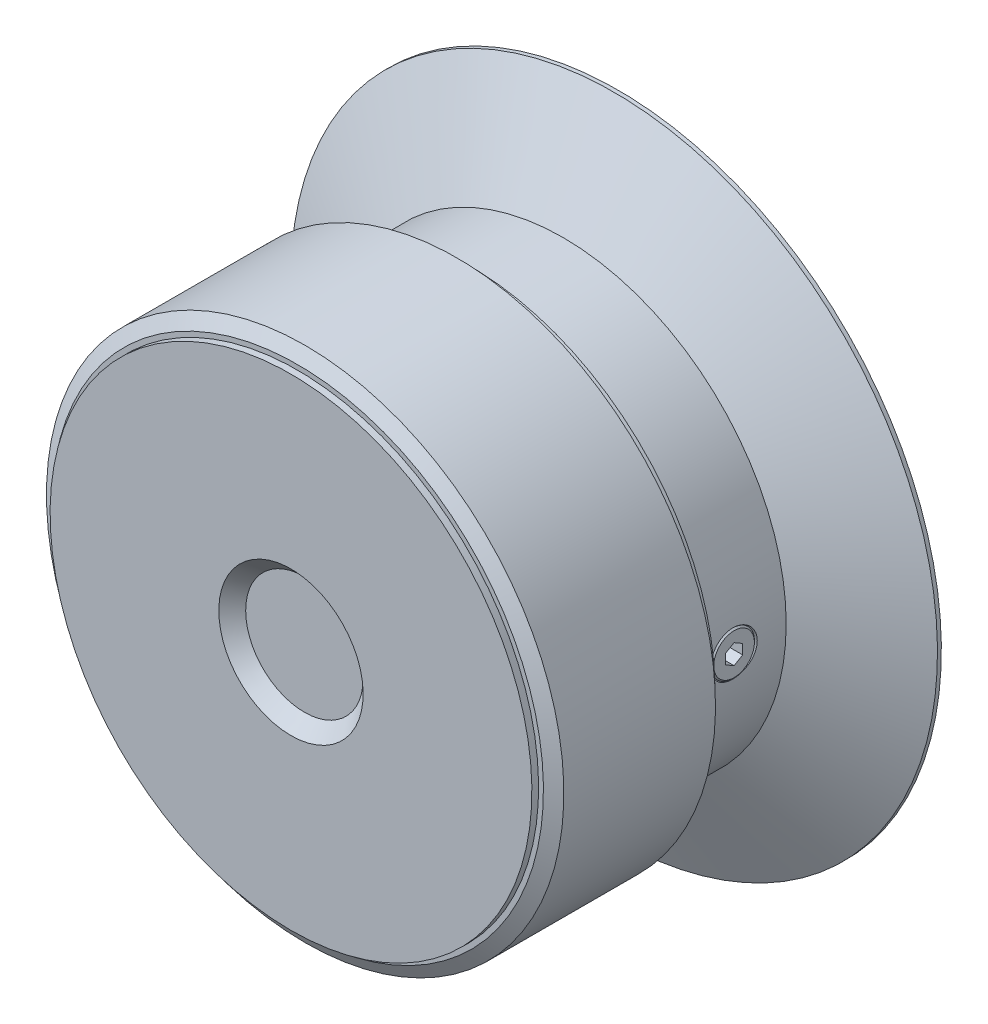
ISO-10303-21;
HEADER;
FILE_DESCRIPTION(('STEP AP214'),'2;1');
FILE_NAME('part.step','',(''),(''),'','','');
FILE_SCHEMA(('AUTOMOTIVE_DESIGN { 1 0 10303 214 1 1 1 1 }'));
ENDSEC;
DATA;
#1=APPLICATION_CONTEXT('core data for automotive mechanical design processes');
#2=APPLICATION_PROTOCOL_DEFINITION('international standard','automotive_design',2000,#1);
#3=PRODUCT_CONTEXT('',#1,'mechanical');
#4=PRODUCT('Part','Part','',(#3));
#5=PRODUCT_RELATED_PRODUCT_CATEGORY('part','',(#4));
#6=PRODUCT_DEFINITION_FORMATION('','',#4);
#7=PRODUCT_DEFINITION_CONTEXT('part definition',#1,'design');
#8=PRODUCT_DEFINITION('design','',#6,#7);
#9=PRODUCT_DEFINITION_SHAPE('','',#8);
#10=(LENGTH_UNIT() NAMED_UNIT(*) SI_UNIT(.MILLI.,.METRE.));
#11=(NAMED_UNIT(*) PLANE_ANGLE_UNIT() SI_UNIT($,.RADIAN.));
#12=(NAMED_UNIT(*) SI_UNIT($,.STERADIAN.) SOLID_ANGLE_UNIT());
#13=UNCERTAINTY_MEASURE_WITH_UNIT(LENGTH_MEASURE(1.E-05),#10,'distance_accuracy_value','');
#14=(GEOMETRIC_REPRESENTATION_CONTEXT(3) GLOBAL_UNCERTAINTY_ASSIGNED_CONTEXT((#13)) GLOBAL_UNIT_ASSIGNED_CONTEXT((#10,
#11,#12)) REPRESENTATION_CONTEXT('',''));
#15=CARTESIAN_POINT('',(0.,0.,0.));
#16=DIRECTION('',(0.,0.,1.));
#17=DIRECTION('',(1.,0.,0.));
#18=AXIS2_PLACEMENT_3D('',#15,#16,#17);
#19=CARTESIAN_POINT('',(17.45,0.,9.));
#20=DIRECTION('',(1.,0.,0.));
#21=DIRECTION('',(0.,0.,-1.));
#22=AXIS2_PLACEMENT_3D('',#19,#20,#21);
#23=CONICAL_SURFACE('',#22,2.,0.785398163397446);
#24=CARTESIAN_POINT('',(17.2061921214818,-1.22859785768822,7.7451063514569));
#25=CARTESIAN_POINT('',(17.2104098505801,-1.16952644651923,7.68137068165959));
#26=CARTESIAN_POINT('',(17.2146587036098,-1.10573725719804,7.62199444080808));
#27=CARTESIAN_POINT('',(17.2228450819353,-0.96991517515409,7.51346370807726));
#28=CARTESIAN_POINT('',(17.2267824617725,-0.897878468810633,7.46431397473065));
#29=CARTESIAN_POINT('',(17.2344139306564,-0.737976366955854,7.372427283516));
#30=CARTESIAN_POINT('',(17.2380219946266,-0.649249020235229,7.33116963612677));
#31=CARTESIAN_POINT('',(17.2439514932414,-0.465876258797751,7.26485773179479));
#32=CARTESIAN_POINT('',(17.24627290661,-0.371230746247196,7.2398037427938));
#33=CARTESIAN_POINT('',(17.249273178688,-0.183131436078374,7.20764057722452));
#34=CARTESIAN_POINT('',(17.2500187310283,-0.0898031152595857,7.19980220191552));
#35=CARTESIAN_POINT('',(17.2499805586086,0.0968043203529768,7.20020531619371));
#36=CARTESIAN_POINT('',(17.249197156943,0.190083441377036,7.2084434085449));
#37=CARTESIAN_POINT('',(17.2462249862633,0.371925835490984,7.2403300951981));
#38=CARTESIAN_POINT('',(17.2440658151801,0.460546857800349,7.26365428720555));
#39=CARTESIAN_POINT('',(17.2386081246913,0.632704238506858,7.32454932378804));
#40=CARTESIAN_POINT('',(17.2353095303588,0.716240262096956,7.36212110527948));
#41=CARTESIAN_POINT('',(17.2278575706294,0.877533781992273,7.45102359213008));
#42=CARTESIAN_POINT('',(17.2236900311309,0.95516190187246,7.50258737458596));
#43=CARTESIAN_POINT('',(17.2149764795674,1.10110874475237,7.61749740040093));
#44=CARTESIAN_POINT('',(17.2104303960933,1.16942570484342,7.68084586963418));
#45=CARTESIAN_POINT('',(17.2012193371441,1.2980367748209,7.82048865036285));
#46=CARTESIAN_POINT('',(17.1965579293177,1.35784573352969,7.89722987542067));
#47=CARTESIAN_POINT('',(17.1878114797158,1.4644122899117,8.05931965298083));
#48=CARTESIAN_POINT('',(17.1837265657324,1.51116699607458,8.144670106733));
#49=CARTESIAN_POINT('',(17.1763831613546,1.59251852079,8.32578252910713));
#50=CARTESIAN_POINT('',(17.1731714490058,1.62645551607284,8.42184307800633));
#51=CARTESIAN_POINT('',(17.1681818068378,1.67830719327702,8.61823209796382));
#52=CARTESIAN_POINT('',(17.1664041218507,1.69621913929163,8.71856129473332));
#53=CARTESIAN_POINT('',(17.1644443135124,1.71594236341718,8.92383024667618));
#54=CARTESIAN_POINT('',(17.1643112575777,1.71725853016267,9.02881834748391));
#55=CARTESIAN_POINT('',(17.1657834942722,1.70247747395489,9.23755670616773));
#56=CARTESIAN_POINT('',(17.1673889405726,1.68637871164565,9.34130685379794));
#57=CARTESIAN_POINT('',(17.172174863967,1.63692652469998,9.54539605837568));
#58=CARTESIAN_POINT('',(17.1753668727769,1.6034466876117,9.64570430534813));
#59=CARTESIAN_POINT('',(17.1829609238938,1.51990264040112,9.83912569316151));
#60=CARTESIAN_POINT('',(17.1873629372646,1.46983882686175,9.93223900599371));
#61=CARTESIAN_POINT('',(17.1967755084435,1.35523189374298,10.1069272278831));
#62=CARTESIAN_POINT('',(17.2017751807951,1.29093372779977,10.1886631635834));
#63=CARTESIAN_POINT('',(17.2118370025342,1.14900408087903,10.3396117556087));
#64=CARTESIAN_POINT('',(17.2168991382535,1.0713754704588,10.4088271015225));
#65=CARTESIAN_POINT('',(17.2262619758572,0.908186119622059,10.5297682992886));
#66=CARTESIAN_POINT('',(17.2305848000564,0.823057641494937,10.5820751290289));
#67=CARTESIAN_POINT('',(17.2381728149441,0.644848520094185,10.6708131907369));
#68=CARTESIAN_POINT('',(17.2414383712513,0.551770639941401,10.7072499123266));
#69=CARTESIAN_POINT('',(17.246371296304,0.365293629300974,10.7613802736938));
#70=CARTESIAN_POINT('',(17.2481100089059,0.27214022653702,10.7799152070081));
#71=CARTESIAN_POINT('',(17.2500515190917,0.0840215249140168,10.8005757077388));
#72=CARTESIAN_POINT('',(17.2502546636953,-0.010943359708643,10.8027049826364));
#73=CARTESIAN_POINT('',(17.2491202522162,-0.196755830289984,10.7906736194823));
#74=CARTESIAN_POINT('',(17.2478318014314,-0.287637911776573,10.7770321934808));
#75=CARTESIAN_POINT('',(17.2439395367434,-0.465827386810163,10.7348207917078));
#76=CARTESIAN_POINT('',(17.2413357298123,-0.55313479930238,10.7062508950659));
#77=CARTESIAN_POINT('',(17.2350798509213,-0.722313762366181,10.6350033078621));
#78=CARTESIAN_POINT('',(17.2314219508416,-0.804151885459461,10.5922469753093));
#79=CARTESIAN_POINT('',(17.2234529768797,-0.959819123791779,10.494100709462));
#80=CARTESIAN_POINT('',(17.2191418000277,-1.03364697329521,10.4387087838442));
#81=CARTESIAN_POINT('',(17.2101368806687,-1.17424275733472,10.3146606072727));
#82=CARTESIAN_POINT('',(17.2054348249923,-1.24063557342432,10.2455801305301));
#83=CARTESIAN_POINT('',(17.1962916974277,-1.36151974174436,10.0976817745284));
#84=CARTESIAN_POINT('',(17.1918506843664,-1.41600841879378,10.0188617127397));
#85=CARTESIAN_POINT('',(17.1834810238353,-1.51427760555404,9.84966040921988));
#86=CARTESIAN_POINT('',(17.1795871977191,-1.55741865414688,9.75890585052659));
#87=CARTESIAN_POINT('',(17.1729949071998,-1.62850393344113,9.57159046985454));
#88=CARTESIAN_POINT('',(17.1702966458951,-1.65644558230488,9.47502866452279));
#89=CARTESIAN_POINT('',(17.1663080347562,-1.69729562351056,9.27509435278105));
#90=CARTESIAN_POINT('',(17.16507215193,-1.70962357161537,9.17160183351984));
#91=CARTESIAN_POINT('',(17.1643264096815,-1.71709415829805,8.96397137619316));
#92=CARTESIAN_POINT('',(17.1648169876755,-1.71223244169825,8.85983328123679));
#93=CARTESIAN_POINT('',(17.1674902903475,-1.6852191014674,8.65225409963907));
#94=CARTESIAN_POINT('',(17.1696982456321,-1.66280964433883,8.54884680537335));
#95=CARTESIAN_POINT('',(17.1755833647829,-1.60087403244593,8.34737140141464));
#96=CARTESIAN_POINT('',(17.1792595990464,-1.56135870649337,8.24929995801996));
#97=CARTESIAN_POINT('',(17.1867804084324,-1.4759754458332,8.0808203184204));
#98=CARTESIAN_POINT('',(17.1904343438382,-1.43309244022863,8.00887492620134));
#99=CARTESIAN_POINT('',(17.1981134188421,-1.3377887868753,7.87164808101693));
#100=CARTESIAN_POINT('',(17.2021383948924,-1.28537233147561,7.80636371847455));
#101=CARTESIAN_POINT('',(17.2061921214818,-1.22859785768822,7.7451063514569));
#102=B_SPLINE_CURVE_WITH_KNOTS('',3,(#24,#25,#26,#27,#28,#29,#30,#31,#32,#33,#34,#35,#36,#37,
#38,#39,#40,#41,#42,#43,#44,#45,#46,#47,#48,#49,#50,#51,#52,#53,#54,#55,#56,#57,#58,#59,#60,#61,
#62,#63,#64,#65,#66,#67,#68,#69,#70,#71,#72,#73,#74,#75,#76,#77,#78,#79,#80,#81,#82,#83,#84,#85,
#86,#87,#88,#89,#90,#91,#92,#93,#94,#95,#96,#97,#98,#99,#100,#101),.UNSPECIFIED.,.T.,.F.,(4,2,2,
2,2,2,2,2,2,2,2,2,2,2,2,2,2,2,2,2,2,2,2,2,2,2,2,2,2,2,2,2,2,2,2,2,2,2,4),(0.,0.260775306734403,
0.521671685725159,0.813904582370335,1.1061423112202,1.38574167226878,1.6652819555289,
1.93900248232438,2.21274101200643,2.49135368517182,2.77001903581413,3.06094336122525,
3.35193207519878,3.6563350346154,3.96078995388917,4.27430707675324,4.58785191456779,
4.90370978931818,5.21956011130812,5.53034762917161,5.84106830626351,6.13956364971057,
6.4379556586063,6.72152223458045,7.00502472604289,7.27945311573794,7.5538800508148,
7.8298544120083,8.10587231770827,8.39238400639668,8.67896001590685,8.97929036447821,
9.27967171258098,9.5909202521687,9.90224765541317,10.2182373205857,10.5340272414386,
10.7847725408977,11.0354078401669),.UNSPECIFIED.);
#103=CARTESIAN_POINT('',(17.2061921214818,-1.22859785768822,7.7451063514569));
#104=VERTEX_POINT('',#103);
#105=EDGE_CURVE('E18',#104,#104,#102,.T.);
#106=ORIENTED_EDGE('',*,*,#105,.T.);
#107=EDGE_LOOP('',(#106));
#108=FACE_BOUND('',#107,.T.);
#109=CARTESIAN_POINT('',(17.139,0.,9.));
#110=DIRECTION('',(1.,0.,0.));
#111=DIRECTION('',(0.,0.,-1.));
#112=AXIS2_PLACEMENT_3D('',#109,#110,#111);
#113=CIRCLE('',#112,1.689);
#114=CARTESIAN_POINT('',(17.139,0.,7.311));
#115=VERTEX_POINT('',#114);
#116=EDGE_CURVE('E9',#115,#115,#113,.T.);
#117=ORIENTED_EDGE('',*,*,#116,.F.);
#118=EDGE_LOOP('',(#117));
#119=FACE_BOUND('',#118,.T.);
#120=ADVANCED_FACE('F14',(#108,#119),#23,.F.);
#121=CARTESIAN_POINT('',(0.,0.,12.6));
#122=DIRECTION('',(0.,0.,1.));
#123=DIRECTION('',(0.,-1.,0.));
#124=AXIS2_PLACEMENT_3D('',#121,#122,#123);
#125=CONICAL_SURFACE('',#124,19.,1.0471975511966);
#126=CARTESIAN_POINT('',(0.,0.,13.1773502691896));
#127=DIRECTION('',(0.,0.,1.));
#128=DIRECTION('',(0.,-1.,0.));
#129=AXIS2_PLACEMENT_3D('',#126,#127,#128);
#130=CIRCLE('',#129,20.);
#131=CARTESIAN_POINT('',(0.,-20.,13.1773502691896));
#132=VERTEX_POINT('',#131);
#133=EDGE_CURVE('E140',#132,#132,#130,.T.);
#134=ORIENTED_EDGE('',*,*,#133,.F.);
#135=EDGE_LOOP('',(#134));
#136=FACE_BOUND('',#135,.T.);
#137=CARTESIAN_POINT('',(0.,0.,12.6));
#138=DIRECTION('',(0.,0.,1.));
#139=DIRECTION('',(0.,-1.,0.));
#140=AXIS2_PLACEMENT_3D('',#137,#138,#139);
#141=CIRCLE('',#140,19.);
#142=CARTESIAN_POINT('',(0.,-19.,12.6));
#143=VERTEX_POINT('',#142);
#144=EDGE_CURVE('E134',#143,#143,#141,.T.);
#145=ORIENTED_EDGE('',*,*,#144,.T.);
#146=EDGE_LOOP('',(#145));
#147=FACE_BOUND('',#146,.T.);
#148=ADVANCED_FACE('F245',(#136,#147),#125,.T.);
#149=CARTESIAN_POINT('',(0.,0.,26.));
#150=DIRECTION('',(0.,0.,1.));
#151=DIRECTION('',(0.,-1.,0.));
#152=AXIS2_PLACEMENT_3D('',#149,#150,#151);
#153=CYLINDRICAL_SURFACE('',#152,19.);
#154=ORIENTED_EDGE('',*,*,#144,.F.);
#155=EDGE_LOOP('',(#154));
#156=FACE_BOUND('',#155,.T.);
#157=CARTESIAN_POINT('',(0.,0.,12.22));
#158=DIRECTION('',(0.,0.,1.));
#159=DIRECTION('',(0.,-1.,0.));
#160=AXIS2_PLACEMENT_3D('',#157,#158,#159);
#161=CIRCLE('',#160,19.);
#162=CARTESIAN_POINT('',(0.,-19.,12.22));
#163=VERTEX_POINT('',#162);
#164=EDGE_CURVE('E143',#163,#163,#161,.F.);
#165=ORIENTED_EDGE('',*,*,#164,.F.);
#166=EDGE_LOOP('',(#165));
#167=FACE_BOUND('',#166,.T.);
#168=ADVANCED_FACE('F250',(#156,#167),#153,.T.);
#169=CARTESIAN_POINT('',(18.625,0.,12.22));
#170=DIRECTION('',(0.,0.,1.));
#171=DIRECTION('',(0.,-1.,0.));
#172=AXIS2_PLACEMENT_3D('',#169,#170,#171);
#173=PLANE('',#172);
#174=ORIENTED_EDGE('',*,*,#164,.T.);
#175=EDGE_LOOP('',(#174));
#176=FACE_BOUND('',#175,.T.);
#177=CARTESIAN_POINT('',(0.,0.,12.22));
#178=DIRECTION('',(0.,0.,1.));
#179=DIRECTION('',(0.,-1.,0.));
#180=AXIS2_PLACEMENT_3D('',#177,#178,#179);
#181=CIRCLE('',#180,18.625);
#182=CARTESIAN_POINT('',(0.,-18.625,12.22));
#183=VERTEX_POINT('',#182);
#184=EDGE_CURVE('E161',#183,#183,#181,.T.);
#185=ORIENTED_EDGE('',*,*,#184,.T.);
#186=EDGE_LOOP('',(#185));
#187=FACE_BOUND('',#186,.T.);
#188=ADVANCED_FACE('F279',(#176,#187),#173,.F.);
#189=CARTESIAN_POINT('',(0.,0.,26.));
#190=DIRECTION('',(0.,0.,1.));
#191=DIRECTION('',(0.,-1.,0.));
#192=AXIS2_PLACEMENT_3D('',#189,#190,#191);
#193=CYLINDRICAL_SURFACE('',#192,18.625);
#194=ORIENTED_EDGE('',*,*,#184,.F.);
#195=EDGE_LOOP('',(#194));
#196=FACE_BOUND('',#195,.T.);
#197=CARTESIAN_POINT('',(0.,0.,12.));
#198=DIRECTION('',(0.,0.,1.));
#199=DIRECTION('',(0.,-1.,0.));
#200=AXIS2_PLACEMENT_3D('',#197,#198,#199);
#201=CIRCLE('',#200,18.625);
#202=CARTESIAN_POINT('',(0.,-18.625,12.));
#203=VERTEX_POINT('',#202);
#204=EDGE_CURVE('E164',#203,#203,#201,.T.);
#205=ORIENTED_EDGE('',*,*,#204,.T.);
#206=EDGE_LOOP('',(#205));
#207=FACE_BOUND('',#206,.T.);
#208=ADVANCED_FACE('F282',(#196,#207),#193,.T.);
#209=CARTESIAN_POINT('',(17.25,0.,12.));
#210=DIRECTION('',(0.,0.,1.));
#211=DIRECTION('',(0.,-1.,0.));
#212=AXIS2_PLACEMENT_3D('',#209,#210,#211);
#213=PLANE('',#212);
#214=ORIENTED_EDGE('',*,*,#204,.F.);
#215=EDGE_LOOP('',(#214));
#216=FACE_BOUND('',#215,.T.);
#217=CARTESIAN_POINT('',(0.,0.,12.));
#218=DIRECTION('',(0.,0.,1.));
#219=DIRECTION('',(0.,-1.,0.));
#220=AXIS2_PLACEMENT_3D('',#217,#218,#219);
#221=CIRCLE('',#220,17.25);
#222=CARTESIAN_POINT('',(0.,-17.25,12.));
#223=VERTEX_POINT('',#222);
#224=EDGE_CURVE('E167',#223,#223,#221,.T.);
#225=ORIENTED_EDGE('',*,*,#224,.T.);
#226=EDGE_LOOP('',(#225));
#227=FACE_BOUND('',#226,.T.);
#228=ADVANCED_FACE('F200',(#216,#227),#213,.F.);
#229=CARTESIAN_POINT('',(0.,0.,26.));
#230=DIRECTION('',(0.,0.,1.));
#231=DIRECTION('',(0.,-1.,0.));
#232=AXIS2_PLACEMENT_3D('',#229,#230,#231);
#233=CYLINDRICAL_SURFACE('',#232,17.25);
#234=ORIENTED_EDGE('',*,*,#224,.F.);
#235=EDGE_LOOP('',(#234));
#236=FACE_BOUND('',#235,.T.);
#237=ORIENTED_EDGE('',*,*,#105,.F.);
#238=EDGE_LOOP('',(#237));
#239=FACE_BOUND('',#238,.T.);
#240=CARTESIAN_POINT('',(0.,0.,4.96382223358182));
#241=DIRECTION('',(0.,0.,1.));
#242=DIRECTION('',(0.,-1.,0.));
#243=AXIS2_PLACEMENT_3D('',#240,#241,#242);
#244=CIRCLE('',#243,17.25);
#245=CARTESIAN_POINT('',(0.,-17.25,4.96382223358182));
#246=VERTEX_POINT('',#245);
#247=EDGE_CURVE('E170',#246,#246,#244,.T.);
#248=ORIENTED_EDGE('',*,*,#247,.T.);
#249=EDGE_LOOP('',(#248));
#250=FACE_BOUND('',#249,.T.);
#251=ADVANCED_FACE('F196',(#236,#239,#250),#233,.T.);
#252=CARTESIAN_POINT('',(0.,0.,1.015));
#253=DIRECTION('',(0.,0.,-1.));
#254=DIRECTION('',(0.,1.,0.));
#255=AXIS2_PLACEMENT_3D('',#252,#253,#254);
#256=CONICAL_SURFACE('',#255,25.,1.09955742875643);
#257=ORIENTED_EDGE('',*,*,#247,.F.);
#258=EDGE_LOOP('',(#257));
#259=FACE_BOUND('',#258,.T.);
#260=CARTESIAN_POINT('',(0.,0.,1.015));
#261=DIRECTION('',(0.,0.,1.));
#262=DIRECTION('',(0.,-1.,0.));
#263=AXIS2_PLACEMENT_3D('',#260,#261,#262);
#264=CIRCLE('',#263,25.);
#265=CARTESIAN_POINT('',(0.,-25.,1.015));
#266=VERTEX_POINT('',#265);
#267=EDGE_CURVE('E173',#266,#266,#264,.T.);
#268=ORIENTED_EDGE('',*,*,#267,.T.);
#269=EDGE_LOOP('',(#268));
#270=FACE_BOUND('',#269,.T.);
#271=ADVANCED_FACE('F199',(#259,#270),#256,.T.);
#272=CARTESIAN_POINT('',(0.,0.,26.));
#273=DIRECTION('',(0.,0.,1.));
#274=DIRECTION('',(0.,-1.,0.));
#275=AXIS2_PLACEMENT_3D('',#272,#273,#274);
#276=CYLINDRICAL_SURFACE('',#275,25.);
#277=ORIENTED_EDGE('',*,*,#267,.F.);
#278=EDGE_LOOP('',(#277));
#279=FACE_BOUND('',#278,.T.);
#280=CARTESIAN_POINT('',(0.,0.,0.715));
#281=DIRECTION('',(0.,0.,1.));
#282=DIRECTION('',(0.,-1.,0.));
#283=AXIS2_PLACEMENT_3D('',#280,#281,#282);
#284=CIRCLE('',#283,25.);
#285=CARTESIAN_POINT('',(0.,-25.,0.715));
#286=VERTEX_POINT('',#285);
#287=EDGE_CURVE('E176',#286,#286,#284,.T.);
#288=ORIENTED_EDGE('',*,*,#287,.T.);
#289=EDGE_LOOP('',(#288));
#290=FACE_BOUND('',#289,.T.);
#291=ADVANCED_FACE('F206',(#279,#290),#276,.T.);
#292=CARTESIAN_POINT('',(0.,0.,15.7320508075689));
#293=DIRECTION('',(0.,0.,1.));
#294=DIRECTION('',(0.,-1.,0.));
#295=AXIS2_PLACEMENT_3D('',#292,#293,#294);
#296=CYLINDRICAL_SURFACE('',#295,3.);
#297=CARTESIAN_POINT('',(0.,0.,0.2));
#298=DIRECTION('',(0.,0.,1.));
#299=DIRECTION('',(0.,-1.,0.));
#300=AXIS2_PLACEMENT_3D('',#297,#298,#299);
#301=CIRCLE('',#300,3.);
#302=CARTESIAN_POINT('',(0.,-3.,0.2));
#303=VERTEX_POINT('',#302);
#304=EDGE_CURVE('E146',#303,#303,#301,.T.);
#305=ORIENTED_EDGE('',*,*,#304,.F.);
#306=EDGE_LOOP('',(#305));
#307=FACE_BOUND('',#306,.T.);
#308=CARTESIAN_POINT('',(0.,0.,14.));
#309=DIRECTION('',(0.,0.,-1.));
#310=DIRECTION('',(0.,1.,0.));
#311=AXIS2_PLACEMENT_3D('',#308,#309,#310);
#312=CIRCLE('',#311,3.);
#313=CARTESIAN_POINT('',(0.,3.,14.));
#314=VERTEX_POINT('',#313);
#315=EDGE_CURVE('E100',#314,#314,#312,.T.);
#316=ORIENTED_EDGE('',*,*,#315,.F.);
#317=EDGE_LOOP('',(#316));
#318=FACE_BOUND('',#317,.T.);
#319=ADVANCED_FACE('F212',(#307,#318),#296,.F.);
#320=CARTESIAN_POINT('',(8.8,0.,0.715));
#321=DIRECTION('',(0.,0.,1.));
#322=DIRECTION('',(0.,-1.,0.));
#323=AXIS2_PLACEMENT_3D('',#320,#321,#322);
#324=PLANE('',#323);
#325=ORIENTED_EDGE('',*,*,#287,.F.);
#326=EDGE_LOOP('',(#325));
#327=FACE_BOUND('',#326,.T.);
#328=CARTESIAN_POINT('',(0.,0.,0.715));
#329=DIRECTION('',(0.,0.,1.));
#330=DIRECTION('',(0.,-1.,0.));
#331=AXIS2_PLACEMENT_3D('',#328,#329,#330);
#332=CIRCLE('',#331,8.8);
#333=CARTESIAN_POINT('',(0.,-8.8,0.715));
#334=VERTEX_POINT('',#333);
#335=EDGE_CURVE('E179',#334,#334,#332,.T.);
#336=ORIENTED_EDGE('',*,*,#335,.T.);
#337=EDGE_LOOP('',(#336));
#338=FACE_BOUND('',#337,.T.);
#339=ADVANCED_FACE('F216',(#327,#338),#324,.F.);
#340=CARTESIAN_POINT('',(0.,0.,0.));
#341=DIRECTION('',(0.,0.,-1.));
#342=DIRECTION('',(0.,1.,0.));
#343=AXIS2_PLACEMENT_3D('',#340,#341,#342);
#344=CONICAL_SURFACE('',#343,3.2,0.785398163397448);
#345=ORIENTED_EDGE('',*,*,#304,.T.);
#346=EDGE_LOOP('',(#345));
#347=FACE_BOUND('',#346,.T.);
#348=CARTESIAN_POINT('',(0.,0.,0.));
#349=DIRECTION('',(0.,0.,1.));
#350=DIRECTION('',(0.,-1.,0.));
#351=AXIS2_PLACEMENT_3D('',#348,#349,#350);
#352=CIRCLE('',#351,3.2);
#353=CARTESIAN_POINT('',(0.,-3.2,0.));
#354=VERTEX_POINT('',#353);
#355=EDGE_CURVE('E149',#354,#354,#352,.T.);
#356=ORIENTED_EDGE('',*,*,#355,.F.);
#357=EDGE_LOOP('',(#356));
#358=FACE_BOUND('',#357,.T.);
#359=ADVANCED_FACE('F219',(#347,#358),#344,.F.);
#360=CARTESIAN_POINT('',(0.,0.,0.3));
#361=DIRECTION('',(0.,0.,1.));
#362=DIRECTION('',(0.,-1.,0.));
#363=AXIS2_PLACEMENT_3D('',#360,#361,#362);
#364=CONICAL_SURFACE('',#363,8.,1.09226148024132);
#365=ORIENTED_EDGE('',*,*,#335,.F.);
#366=EDGE_LOOP('',(#365));
#367=FACE_BOUND('',#366,.T.);
#368=CARTESIAN_POINT('',(0.,0.,0.3));
#369=DIRECTION('',(0.,0.,1.));
#370=DIRECTION('',(0.,-1.,0.));
#371=AXIS2_PLACEMENT_3D('',#368,#369,#370);
#372=CIRCLE('',#371,8.);
#373=CARTESIAN_POINT('',(0.,-8.,0.3));
#374=VERTEX_POINT('',#373);
#375=EDGE_CURVE('E182',#374,#374,#372,.T.);
#376=ORIENTED_EDGE('',*,*,#375,.T.);
#377=EDGE_LOOP('',(#376));
#378=FACE_BOUND('',#377,.T.);
#379=ADVANCED_FACE('F223',(#367,#378),#364,.T.);
#380=CARTESIAN_POINT('',(0.,0.,0.));
#381=DIRECTION('',(0.,0.,1.));
#382=DIRECTION('',(0.,-1.,0.));
#383=AXIS2_PLACEMENT_3D('',#380,#381,#382);
#384=PLANE('',#383);
#385=CARTESIAN_POINT('',(0.,0.,0.));
#386=DIRECTION('',(0.,0.,1.));
#387=DIRECTION('',(0.,-1.,0.));
#388=AXIS2_PLACEMENT_3D('',#385,#386,#387);
#389=CIRCLE('',#388,6.);
#390=CARTESIAN_POINT('',(0.,-6.,0.));
#391=VERTEX_POINT('',#390);
#392=EDGE_CURVE('E187',#391,#391,#389,.T.);
#393=ORIENTED_EDGE('',*,*,#392,.F.);
#394=EDGE_LOOP('',(#393));
#395=FACE_BOUND('',#394,.T.);
#396=ORIENTED_EDGE('',*,*,#355,.T.);
#397=EDGE_LOOP('',(#396));
#398=FACE_BOUND('',#397,.T.);
#399=ADVANCED_FACE('F16',(#395,#398),#384,.F.);
#400=CARTESIAN_POINT('',(6.,0.,0.3));
#401=DIRECTION('',(0.,0.,1.));
#402=DIRECTION('',(0.,-1.,0.));
#403=AXIS2_PLACEMENT_3D('',#400,#401,#402);
#404=PLANE('',#403);
#405=ORIENTED_EDGE('',*,*,#375,.F.);
#406=EDGE_LOOP('',(#405));
#407=FACE_BOUND('',#406,.T.);
#408=CARTESIAN_POINT('',(0.,0.,0.3));
#409=DIRECTION('',(0.,0.,1.));
#410=DIRECTION('',(0.,-1.,0.));
#411=AXIS2_PLACEMENT_3D('',#408,#409,#410);
#412=CIRCLE('',#411,6.);
#413=CARTESIAN_POINT('',(0.,-6.,0.3));
#414=VERTEX_POINT('',#413);
#415=EDGE_CURVE('E185',#414,#414,#412,.T.);
#416=ORIENTED_EDGE('',*,*,#415,.T.);
#417=EDGE_LOOP('',(#416));
#418=FACE_BOUND('',#417,.T.);
#419=ADVANCED_FACE('F229',(#407,#418),#404,.F.);
#420=CARTESIAN_POINT('',(0.,0.,26.));
#421=DIRECTION('',(0.,0.,1.));
#422=DIRECTION('',(0.,-1.,0.));
#423=AXIS2_PLACEMENT_3D('',#420,#421,#422);
#424=CYLINDRICAL_SURFACE('',#423,6.);
#425=ORIENTED_EDGE('',*,*,#415,.F.);
#426=EDGE_LOOP('',(#425));
#427=FACE_BOUND('',#426,.T.);
#428=ORIENTED_EDGE('',*,*,#392,.T.);
#429=EDGE_LOOP('',(#428));
#430=FACE_BOUND('',#429,.T.);
#431=ADVANCED_FACE('F232',(#427,#430),#424,.T.);
#432=CARTESIAN_POINT('',(17.2575,0.,9.));
#433=DIRECTION('',(-1.,0.,0.));
#434=DIRECTION('',(0.,-1.,0.));
#435=AXIS2_PLACEMENT_3D('',#432,#433,#434);
#436=PLANE('',#435);
#437=CARTESIAN_POINT('',(17.2575,0.,9.));
#438=DIRECTION('',(-1.,0.,0.));
#439=DIRECTION('',(0.,-1.,0.));
#440=AXIS2_PLACEMENT_3D('',#437,#438,#439);
#441=CIRCLE('',#440,1.5705);
#442=CARTESIAN_POINT('',(17.2575,-1.5705,9.));
#443=VERTEX_POINT('',#442);
#444=EDGE_CURVE('E79',#443,#443,#441,.T.);
#445=ORIENTED_EDGE('',*,*,#444,.F.);
#446=EDGE_LOOP('',(#445));
#447=FACE_BOUND('',#446,.T.);
#448=DIRECTION('',(0.,1.,0.));
#449=VECTOR('',#448,1.);
#450=CARTESIAN_POINT('',(17.2575,0.,8.33333333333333));
#451=LINE('',#450,#449);
#452=CARTESIAN_POINT('',(17.2575,-0.384900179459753,8.33333333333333));
#453=VERTEX_POINT('',#452);
#454=CARTESIAN_POINT('',(17.2575,0.384900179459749,8.33333333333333));
#455=VERTEX_POINT('',#454);
#456=EDGE_CURVE('E28',#453,#455,#451,.T.);
#457=ORIENTED_EDGE('',*,*,#456,.F.);
#458=DIRECTION('',(0.,0.5,-0.866025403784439));
#459=VECTOR('',#458,1.);
#460=CARTESIAN_POINT('',(17.2575,-0.577350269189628,8.66666666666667));
#461=LINE('',#460,#459);
#462=CARTESIAN_POINT('',(17.2575,-0.769800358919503,9.));
#463=VERTEX_POINT('',#462);
#464=EDGE_CURVE('E119',#463,#453,#461,.T.);
#465=ORIENTED_EDGE('',*,*,#464,.F.);
#466=DIRECTION('',(0.,-0.5,-0.866025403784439));
#467=VECTOR('',#466,1.);
#468=CARTESIAN_POINT('',(17.2575,-0.577350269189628,9.33333333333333));
#469=LINE('',#468,#467);
#470=CARTESIAN_POINT('',(17.2575,-0.384900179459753,9.66666666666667));
#471=VERTEX_POINT('',#470);
#472=EDGE_CURVE('E121',#471,#463,#469,.T.);
#473=ORIENTED_EDGE('',*,*,#472,.F.);
#474=DIRECTION('',(0.,-1.,0.));
#475=VECTOR('',#474,1.);
#476=CARTESIAN_POINT('',(17.2575,0.,9.66666666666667));
#477=LINE('',#476,#475);
#478=CARTESIAN_POINT('',(17.2575,0.384900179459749,9.66666666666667));
#479=VERTEX_POINT('',#478);
#480=EDGE_CURVE('E123',#479,#471,#477,.T.);
#481=ORIENTED_EDGE('',*,*,#480,.F.);
#482=DIRECTION('',(0.,-0.5,0.866025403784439));
#483=VECTOR('',#482,1.);
#484=CARTESIAN_POINT('',(17.2575,0.577350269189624,9.33333333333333));
#485=LINE('',#484,#483);
#486=CARTESIAN_POINT('',(17.2575,0.769800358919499,9.));
#487=VERTEX_POINT('',#486);
#488=EDGE_CURVE('E125',#487,#479,#485,.T.);
#489=ORIENTED_EDGE('',*,*,#488,.F.);
#490=DIRECTION('',(0.,0.5,0.866025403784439));
#491=VECTOR('',#490,1.);
#492=CARTESIAN_POINT('',(17.2575,0.577350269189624,8.66666666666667));
#493=LINE('',#492,#491);
#494=EDGE_CURVE('E128',#455,#487,#493,.T.);
#495=ORIENTED_EDGE('',*,*,#494,.F.);
#496=EDGE_LOOP('',(#457,#465,#473,#481,#489,#495));
#497=FACE_BOUND('',#496,.T.);
#498=ADVANCED_FACE('F237',(#447,#497),#436,.F.);
#499=CARTESIAN_POINT('',(17.2575,0.,9.));
#500=DIRECTION('',(-1.,0.,0.));
#501=DIRECTION('',(0.,-1.,0.));
#502=AXIS2_PLACEMENT_3D('',#499,#500,#501);
#503=CONICAL_SURFACE('',#502,1.5705,0.785398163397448);
#504=ORIENTED_EDGE('',*,*,#116,.T.);
#505=EDGE_LOOP('',(#504));
#506=FACE_BOUND('',#505,.T.);
#507=ORIENTED_EDGE('',*,*,#444,.T.);
#508=EDGE_LOOP('',(#507));
#509=FACE_BOUND('',#508,.T.);
#510=ADVANCED_FACE('F242',(#506,#509),#503,.T.);
#511=CARTESIAN_POINT('',(19.25,-0.384900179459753,8.33333333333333));
#512=DIRECTION('',(0.,0.,1.));
#513=DIRECTION('',(0.,-1.,0.));
#514=AXIS2_PLACEMENT_3D('',#511,#512,#513);
#515=PLANE('',#514);
#516=ORIENTED_EDGE('',*,*,#456,.T.);
#517=DIRECTION('',(-1.,0.,0.));
#518=VECTOR('',#517,1.);
#519=CARTESIAN_POINT('',(19.25,0.384900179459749,8.33333333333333));
#520=LINE('',#519,#518);
#521=CARTESIAN_POINT('',(15.25,0.384900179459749,8.33333333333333));
#522=VERTEX_POINT('',#521);
#523=EDGE_CURVE('E72',#455,#522,#520,.T.);
#524=ORIENTED_EDGE('',*,*,#523,.T.);
#525=DIRECTION('',(0.,1.,0.));
#526=VECTOR('',#525,1.);
#527=CARTESIAN_POINT('',(15.25,-0.384900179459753,8.33333333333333));
#528=LINE('',#527,#526);
#529=CARTESIAN_POINT('',(15.25,-0.384900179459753,8.33333333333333));
#530=VERTEX_POINT('',#529);
#531=EDGE_CURVE('E76',#530,#522,#528,.T.);
#532=ORIENTED_EDGE('',*,*,#531,.F.);
#533=DIRECTION('',(-1.,0.,0.));
#534=VECTOR('',#533,1.);
#535=CARTESIAN_POINT('',(19.25,-0.384900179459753,8.33333333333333));
#536=LINE('',#535,#534);
#537=EDGE_CURVE('E109',#453,#530,#536,.T.);
#538=ORIENTED_EDGE('',*,*,#537,.F.);
#539=EDGE_LOOP('',(#516,#524,#532,#538));
#540=FACE_BOUND('',#539,.T.);
#541=ADVANCED_FACE('F74',(#540),#515,.T.);
#542=CARTESIAN_POINT('',(19.25,0.384900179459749,8.33333333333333));
#543=DIRECTION('',(0.,-0.866025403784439,0.5));
#544=DIRECTION('',(0.,-0.5,-0.866025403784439));
#545=AXIS2_PLACEMENT_3D('',#542,#543,#544);
#546=PLANE('',#545);
#547=ORIENTED_EDGE('',*,*,#494,.T.);
#548=DIRECTION('',(-1.,0.,0.));
#549=VECTOR('',#548,1.);
#550=CARTESIAN_POINT('',(19.25,0.769800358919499,9.));
#551=LINE('',#550,#549);
#552=CARTESIAN_POINT('',(15.25,0.769800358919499,9.));
#553=VERTEX_POINT('',#552);
#554=EDGE_CURVE('E80',#487,#553,#551,.T.);
#555=ORIENTED_EDGE('',*,*,#554,.T.);
#556=DIRECTION('',(0.,0.5,0.866025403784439));
#557=VECTOR('',#556,1.);
#558=CARTESIAN_POINT('',(15.25,0.384900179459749,8.33333333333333));
#559=LINE('',#558,#557);
#560=EDGE_CURVE('E83',#522,#553,#559,.T.);
#561=ORIENTED_EDGE('',*,*,#560,.F.);
#562=ORIENTED_EDGE('',*,*,#523,.F.);
#563=EDGE_LOOP('',(#547,#555,#561,#562));
#564=FACE_BOUND('',#563,.T.);
#565=ADVANCED_FACE('F84',(#564),#546,.T.);
#566=CARTESIAN_POINT('',(19.25,0.769800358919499,9.));
#567=DIRECTION('',(0.,-0.866025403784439,-0.5));
#568=DIRECTION('',(0.,0.5,-0.866025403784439));
#569=AXIS2_PLACEMENT_3D('',#566,#567,#568);
#570=PLANE('',#569);
#571=ORIENTED_EDGE('',*,*,#488,.T.);
#572=DIRECTION('',(-1.,0.,0.));
#573=VECTOR('',#572,1.);
#574=CARTESIAN_POINT('',(19.25,0.384900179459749,9.66666666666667));
#575=LINE('',#574,#573);
#576=CARTESIAN_POINT('',(15.25,0.384900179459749,9.66666666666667));
#577=VERTEX_POINT('',#576);
#578=EDGE_CURVE('E114',#479,#577,#575,.T.);
#579=ORIENTED_EDGE('',*,*,#578,.T.);
#580=DIRECTION('',(0.,-0.5,0.866025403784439));
#581=VECTOR('',#580,1.);
#582=CARTESIAN_POINT('',(15.25,0.769800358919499,9.));
#583=LINE('',#582,#581);
#584=EDGE_CURVE('E89',#553,#577,#583,.T.);
#585=ORIENTED_EDGE('',*,*,#584,.F.);
#586=ORIENTED_EDGE('',*,*,#554,.F.);
#587=EDGE_LOOP('',(#571,#579,#585,#586));
#588=FACE_BOUND('',#587,.T.);
#589=ADVANCED_FACE('F381',(#588),#570,.T.);
#590=CARTESIAN_POINT('',(19.25,0.384900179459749,9.66666666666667));
#591=DIRECTION('',(0.,0.,-1.));
#592=DIRECTION('',(0.,1.,0.));
#593=AXIS2_PLACEMENT_3D('',#590,#591,#592);
#594=PLANE('',#593);
#595=ORIENTED_EDGE('',*,*,#578,.F.);
#596=ORIENTED_EDGE('',*,*,#480,.T.);
#597=DIRECTION('',(-1.,0.,0.));
#598=VECTOR('',#597,1.);
#599=CARTESIAN_POINT('',(19.25,-0.384900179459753,9.66666666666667));
#600=LINE('',#599,#598);
#601=CARTESIAN_POINT('',(15.25,-0.384900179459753,9.66666666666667));
#602=VERTEX_POINT('',#601);
#603=EDGE_CURVE('E112',#471,#602,#600,.T.);
#604=ORIENTED_EDGE('',*,*,#603,.T.);
#605=DIRECTION('',(0.,-1.,0.));
#606=VECTOR('',#605,1.);
#607=CARTESIAN_POINT('',(15.25,0.384900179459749,9.66666666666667));
#608=LINE('',#607,#606);
#609=EDGE_CURVE('E103',#577,#602,#608,.T.);
#610=ORIENTED_EDGE('',*,*,#609,.F.);
#611=EDGE_LOOP('',(#595,#596,#604,#610));
#612=FACE_BOUND('',#611,.T.);
#613=ADVANCED_FACE('F390',(#612),#594,.T.);
#614=CARTESIAN_POINT('',(19.25,-0.384900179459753,9.66666666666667));
#615=DIRECTION('',(0.,0.866025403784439,-0.5));
#616=DIRECTION('',(0.,0.5,0.866025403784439));
#617=AXIS2_PLACEMENT_3D('',#614,#615,#616);
#618=PLANE('',#617);
#619=ORIENTED_EDGE('',*,*,#472,.T.);
#620=DIRECTION('',(-1.,0.,0.));
#621=VECTOR('',#620,1.);
#622=CARTESIAN_POINT('',(19.25,-0.769800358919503,9.));
#623=LINE('',#622,#621);
#624=CARTESIAN_POINT('',(15.25,-0.769800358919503,9.));
#625=VERTEX_POINT('',#624);
#626=EDGE_CURVE('E36',#463,#625,#623,.T.);
#627=ORIENTED_EDGE('',*,*,#626,.T.);
#628=DIRECTION('',(0.,-0.5,-0.866025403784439));
#629=VECTOR('',#628,1.);
#630=CARTESIAN_POINT('',(15.25,-0.384900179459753,9.66666666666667));
#631=LINE('',#630,#629);
#632=EDGE_CURVE('E106',#602,#625,#631,.T.);
#633=ORIENTED_EDGE('',*,*,#632,.F.);
#634=ORIENTED_EDGE('',*,*,#603,.F.);
#635=EDGE_LOOP('',(#619,#627,#633,#634));
#636=FACE_BOUND('',#635,.T.);
#637=ADVANCED_FACE('F400',(#636),#618,.T.);
#638=CARTESIAN_POINT('',(19.25,-0.769800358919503,9.));
#639=DIRECTION('',(0.,0.866025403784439,0.5));
#640=DIRECTION('',(0.,-0.5,0.866025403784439));
#641=AXIS2_PLACEMENT_3D('',#638,#639,#640);
#642=PLANE('',#641);
#643=ORIENTED_EDGE('',*,*,#464,.T.);
#644=ORIENTED_EDGE('',*,*,#537,.T.);
#645=DIRECTION('',(0.,0.5,-0.866025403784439));
#646=VECTOR('',#645,1.);
#647=CARTESIAN_POINT('',(15.25,-0.769800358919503,9.));
#648=LINE('',#647,#646);
#649=EDGE_CURVE('E94',#625,#530,#648,.T.);
#650=ORIENTED_EDGE('',*,*,#649,.F.);
#651=ORIENTED_EDGE('',*,*,#626,.F.);
#652=EDGE_LOOP('',(#643,#644,#650,#651));
#653=FACE_BOUND('',#652,.T.);
#654=ADVANCED_FACE('F410',(#653),#642,.T.);
#655=CARTESIAN_POINT('',(15.25,0.,9.));
#656=DIRECTION('',(1.,0.,0.));
#657=DIRECTION('',(0.,1.,0.));
#658=AXIS2_PLACEMENT_3D('',#655,#656,#657);
#659=PLANE('',#658);
#660=ORIENTED_EDGE('',*,*,#531,.T.);
#661=ORIENTED_EDGE('',*,*,#560,.T.);
#662=ORIENTED_EDGE('',*,*,#584,.T.);
#663=ORIENTED_EDGE('',*,*,#609,.T.);
#664=ORIENTED_EDGE('',*,*,#632,.T.);
#665=ORIENTED_EDGE('',*,*,#649,.T.);
#666=EDGE_LOOP('',(#660,#661,#662,#663,#664,#665));
#667=FACE_BOUND('',#666,.T.);
#668=ADVANCED_FACE('F92',(#667),#659,.T.);
#669=CARTESIAN_POINT('',(0.,0.,14.));
#670=DIRECTION('',(0.,0.,-1.));
#671=DIRECTION('',(0.,1.,0.));
#672=AXIS2_PLACEMENT_3D('',#669,#670,#671);
#673=PLANE('',#672);
#674=ORIENTED_EDGE('',*,*,#315,.T.);
#675=EDGE_LOOP('',(#674));
#676=FACE_BOUND('',#675,.T.);
#677=ADVANCED_FACE('F428',(#676),#673,.T.);
#678=CARTESIAN_POINT('',(4.58139534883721,0.,24.96));
#679=DIRECTION('',(0.,0.,-1.));
#680=DIRECTION('',(0.,1.,0.));
#681=AXIS2_PLACEMENT_3D('',#678,#679,#680);
#682=PLANE('',#681);
#683=CARTESIAN_POINT('',(0.,0.,24.96));
#684=DIRECTION('',(0.,0.,-1.));
#685=DIRECTION('',(0.,1.,0.));
#686=AXIS2_PLACEMENT_3D('',#683,#684,#685);
#687=CIRCLE('',#686,4.54139534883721);
#688=CARTESIAN_POINT('',(0.,4.54139534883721,24.96));
#689=VERTEX_POINT('',#688);
#690=EDGE_CURVE('E95',#689,#689,#687,.T.);
#691=ORIENTED_EDGE('',*,*,#690,.F.);
#692=EDGE_LOOP('',(#691));
#693=FACE_BOUND('',#692,.T.);
#694=ADVANCED_FACE('F261',(#693),#682,.F.);
#695=CARTESIAN_POINT('',(0.,0.,26.));
#696=DIRECTION('',(0.,0.,1.));
#697=DIRECTION('',(0.,-1.,0.));
#698=AXIS2_PLACEMENT_3D('',#695,#696,#697);
#699=CONICAL_SURFACE('',#698,5.58139534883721,0.785398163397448);
#700=CARTESIAN_POINT('',(0.,0.,26.));
#701=DIRECTION('',(0.,0.,1.));
#702=DIRECTION('',(0.,-1.,0.));
#703=AXIS2_PLACEMENT_3D('',#700,#701,#702);
#704=CIRCLE('',#703,5.58139534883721);
#705=CARTESIAN_POINT('',(0.,-5.58139534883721,26.));
#706=VERTEX_POINT('',#705);
#707=EDGE_CURVE('E152',#706,#706,#704,.T.);
#708=ORIENTED_EDGE('',*,*,#707,.T.);
#709=EDGE_LOOP('',(#708));
#710=FACE_BOUND('',#709,.T.);
#711=ORIENTED_EDGE('',*,*,#690,.T.);
#712=EDGE_LOOP('',(#711));
#713=FACE_BOUND('',#712,.T.);
#714=ADVANCED_FACE('F257',(#710,#713),#699,.F.);
#715=CARTESIAN_POINT('',(18.625,0.,26.));
#716=DIRECTION('',(0.,0.,-1.));
#717=DIRECTION('',(0.,1.,0.));
#718=AXIS2_PLACEMENT_3D('',#715,#716,#717);
#719=PLANE('',#718);
#720=ORIENTED_EDGE('',*,*,#707,.F.);
#721=EDGE_LOOP('',(#720));
#722=FACE_BOUND('',#721,.T.);
#723=CARTESIAN_POINT('',(0.,0.,26.));
#724=DIRECTION('',(0.,0.,1.));
#725=DIRECTION('',(0.,-1.,0.));
#726=AXIS2_PLACEMENT_3D('',#723,#724,#725);
#727=CIRCLE('',#726,18.625);
#728=CARTESIAN_POINT('',(0.,-18.625,26.));
#729=VERTEX_POINT('',#728);
#730=EDGE_CURVE('E155',#729,#729,#727,.T.);
#731=ORIENTED_EDGE('',*,*,#730,.T.);
#732=EDGE_LOOP('',(#731));
#733=FACE_BOUND('',#732,.T.);
#734=ADVANCED_FACE('F260',(#722,#733),#719,.F.);
#735=CARTESIAN_POINT('',(0.,0.,26.));
#736=DIRECTION('',(0.,0.,1.));
#737=DIRECTION('',(0.,-1.,0.));
#738=AXIS2_PLACEMENT_3D('',#735,#736,#737);
#739=CYLINDRICAL_SURFACE('',#738,18.625);
#740=ORIENTED_EDGE('',*,*,#730,.F.);
#741=EDGE_LOOP('',(#740));
#742=FACE_BOUND('',#741,.T.);
#743=CARTESIAN_POINT('',(0.,0.,25.48));
#744=DIRECTION('',(0.,0.,1.));
#745=DIRECTION('',(0.,-1.,0.));
#746=AXIS2_PLACEMENT_3D('',#743,#744,#745);
#747=CIRCLE('',#746,18.625);
#748=CARTESIAN_POINT('',(0.,-18.625,25.48));
#749=VERTEX_POINT('',#748);
#750=EDGE_CURVE('E158',#749,#749,#747,.T.);
#751=ORIENTED_EDGE('',*,*,#750,.T.);
#752=EDGE_LOOP('',(#751));
#753=FACE_BOUND('',#752,.T.);
#754=ADVANCED_FACE('F265',(#742,#753),#739,.T.);
#755=CARTESIAN_POINT('',(0.,0.,26.));
#756=DIRECTION('',(0.,0.,1.));
#757=DIRECTION('',(0.,-1.,0.));
#758=AXIS2_PLACEMENT_3D('',#755,#756,#757);
#759=CYLINDRICAL_SURFACE('',#758,20.);
#760=CARTESIAN_POINT('',(0.,0.,24.9026497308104));
#761=DIRECTION('',(0.,0.,-1.));
#762=DIRECTION('',(0.,1.,0.));
#763=AXIS2_PLACEMENT_3D('',#760,#761,#762);
#764=CIRCLE('',#763,20.);
#765=CARTESIAN_POINT('',(0.,20.,24.9026497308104));
#766=VERTEX_POINT('',#765);
#767=EDGE_CURVE('E137',#766,#766,#764,.T.);
#768=ORIENTED_EDGE('',*,*,#767,.T.);
#769=EDGE_LOOP('',(#768));
#770=FACE_BOUND('',#769,.T.);
#771=ORIENTED_EDGE('',*,*,#133,.T.);
#772=EDGE_LOOP('',(#771));
#773=FACE_BOUND('',#772,.T.);
#774=ADVANCED_FACE('F269',(#770,#773),#759,.T.);
#775=CARTESIAN_POINT('',(0.,0.,24.3252994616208));
#776=DIRECTION('',(0.,0.,-1.));
#777=DIRECTION('',(0.,1.,0.));
#778=AXIS2_PLACEMENT_3D('',#775,#776,#777);
#779=CONICAL_SURFACE('',#778,21.,1.0471975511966);
#780=CARTESIAN_POINT('',(0.,0.,25.48));
#781=DIRECTION('',(0.,0.,1.));
#782=DIRECTION('',(0.,-1.,0.));
#783=AXIS2_PLACEMENT_3D('',#780,#781,#782);
#784=CIRCLE('',#783,19.);
#785=CARTESIAN_POINT('',(0.,-19.,25.48));
#786=VERTEX_POINT('',#785);
#787=EDGE_CURVE('E131',#786,#786,#784,.T.);
#788=ORIENTED_EDGE('',*,*,#787,.F.);
#789=EDGE_LOOP('',(#788));
#790=FACE_BOUND('',#789,.T.);
#791=ORIENTED_EDGE('',*,*,#767,.F.);
#792=EDGE_LOOP('',(#791));
#793=FACE_BOUND('',#792,.T.);
#794=ADVANCED_FACE('F274',(#790,#793),#779,.T.);
#795=CARTESIAN_POINT('',(19.9,0.,25.48));
#796=DIRECTION('',(0.,0.,-1.));
#797=DIRECTION('',(0.,1.,0.));
#798=AXIS2_PLACEMENT_3D('',#795,#796,#797);
#799=PLANE('',#798);
#800=ORIENTED_EDGE('',*,*,#750,.F.);
#801=EDGE_LOOP('',(#800));
#802=FACE_BOUND('',#801,.T.);
#803=ORIENTED_EDGE('',*,*,#787,.T.);
#804=EDGE_LOOP('',(#803));
#805=FACE_BOUND('',#804,.T.);
#806=ADVANCED_FACE('F271',(#802,#805),#799,.F.);
#807=CLOSED_SHELL('',(#120,#148,#168,#188,#208,#228,#251,#271,#291,#319,#339,#359,#379,#399,
#419,#431,#498,#510,#541,#565,#589,#613,#637,#654,#668,#677,#694,#714,#734,#754,#774,#794,#806));
#808=MANIFOLD_SOLID_BREP('B1',#807);
#809=ADVANCED_BREP_SHAPE_REPRESENTATION('',(#18,#808),#14);
#810=SHAPE_DEFINITION_REPRESENTATION(#9,#809);
ENDSEC;
END-ISO-10303-21;
